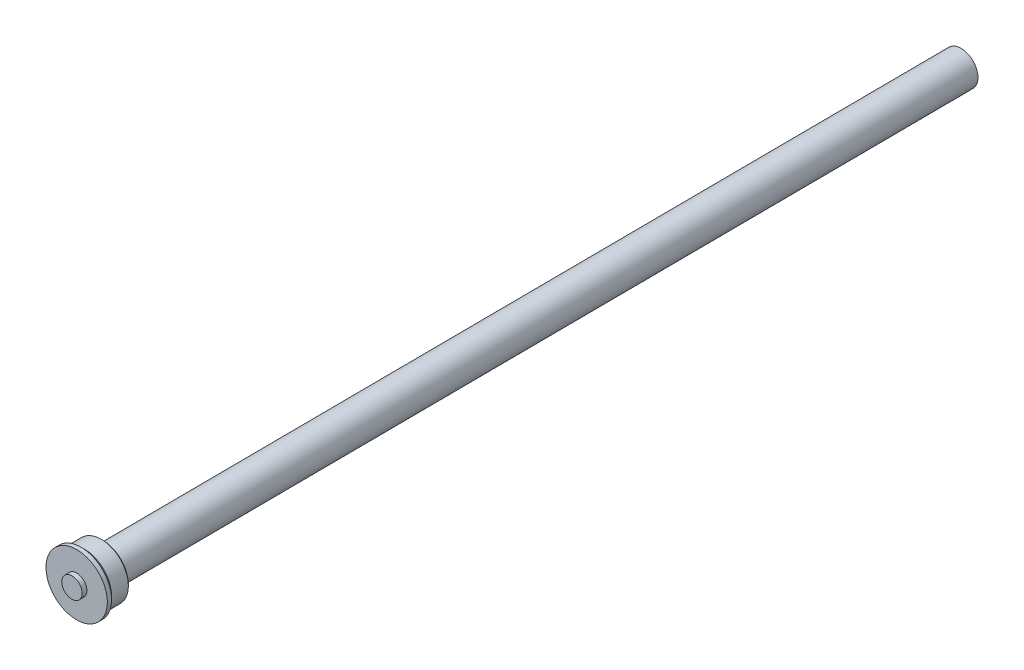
ISO-10303-21;
HEADER;
FILE_DESCRIPTION(('STEP AP214'),'2;1');
FILE_NAME('part.step','',(''),(''),'','','');
FILE_SCHEMA(('AUTOMOTIVE_DESIGN { 1 0 10303 214 1 1 1 1 }'));
ENDSEC;
DATA;
#1=APPLICATION_CONTEXT('core data for automotive mechanical design processes');
#2=APPLICATION_PROTOCOL_DEFINITION('international standard','automotive_design',2000,#1);
#3=PRODUCT_CONTEXT('',#1,'mechanical');
#4=PRODUCT('Part','Part','',(#3));
#5=PRODUCT_RELATED_PRODUCT_CATEGORY('part','',(#4));
#6=PRODUCT_DEFINITION_FORMATION('','',#4);
#7=PRODUCT_DEFINITION_CONTEXT('part definition',#1,'design');
#8=PRODUCT_DEFINITION('design','',#6,#7);
#9=PRODUCT_DEFINITION_SHAPE('','',#8);
#10=(LENGTH_UNIT() NAMED_UNIT(*) SI_UNIT(.MILLI.,.METRE.));
#11=(NAMED_UNIT(*) PLANE_ANGLE_UNIT() SI_UNIT($,.RADIAN.));
#12=(NAMED_UNIT(*) SI_UNIT($,.STERADIAN.) SOLID_ANGLE_UNIT());
#13=UNCERTAINTY_MEASURE_WITH_UNIT(LENGTH_MEASURE(1.E-05),#10,'distance_accuracy_value','');
#14=(GEOMETRIC_REPRESENTATION_CONTEXT(3) GLOBAL_UNCERTAINTY_ASSIGNED_CONTEXT((#13)) GLOBAL_UNIT_ASSIGNED_CONTEXT((#10,
#11,#12)) REPRESENTATION_CONTEXT('',''));
#15=CARTESIAN_POINT('',(0.,0.,0.));
#16=DIRECTION('',(0.,0.,1.));
#17=DIRECTION('',(1.,0.,0.));
#18=AXIS2_PLACEMENT_3D('',#15,#16,#17);
#19=CARTESIAN_POINT('',(-75.3589322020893,-1.62890534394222E-12,-206.508891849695));
#20=DIRECTION('',(0.00617464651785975,0.,0.999980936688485));
#21=DIRECTION('',(-0.98848518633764,-0.151194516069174,0.00610366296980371));
#22=AXIS2_PLACEMENT_3D('',#19,#20,#21);
#23=CONICAL_SURFACE('',#22,19.,0.785398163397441);
#24=CARTESIAN_POINT('',(-75.3527575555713,-1.62370117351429E-12,-205.508910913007));
#25=DIRECTION('',(-0.00617464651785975,0.,-0.999980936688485));
#26=DIRECTION('',(0.98848518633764,0.151194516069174,-0.00610366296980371));
#27=AXIS2_PLACEMENT_3D('',#24,#25,#26);
#28=CIRCLE('',#27,20.);
#29=CARTESIAN_POINT('',(-55.5830538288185,3.02389032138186,-205.630984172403));
#30=VERTEX_POINT('',#29);
#31=EDGE_CURVE('E28',#30,#30,#28,.F.);
#32=ORIENTED_EDGE('',*,*,#31,.F.);
#33=EDGE_LOOP('',(#32));
#34=FACE_BOUND('',#33,.T.);
#35=CARTESIAN_POINT('',(-75.3589322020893,-1.62890534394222E-12,-206.508891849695));
#36=DIRECTION('',(-0.00617464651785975,0.,-0.999980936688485));
#37=DIRECTION('',(0.98848518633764,0.151194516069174,-0.00610366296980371));
#38=AXIS2_PLACEMENT_3D('',#35,#36,#37);
#39=CIRCLE('',#38,19.);
#40=CARTESIAN_POINT('',(-56.5777136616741,2.87269580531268,-206.624861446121));
#41=VERTEX_POINT('',#40);
#42=EDGE_CURVE('E33',#41,#41,#39,.T.);
#43=ORIENTED_EDGE('',*,*,#42,.F.);
#44=EDGE_LOOP('',(#43));
#45=FACE_BOUND('',#44,.T.);
#46=ADVANCED_FACE('F16',(#34,#45),#23,.T.);
#47=CARTESIAN_POINT('',(-75.2755744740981,-1.66880398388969E-12,-193.009149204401));
#48=DIRECTION('',(0.00617464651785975,0.,0.999980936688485));
#49=DIRECTION('',(-0.98848518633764,-0.151194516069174,0.00610366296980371));
#50=AXIS2_PLACEMENT_3D('',#47,#48,#49);
#51=CONICAL_SURFACE('',#50,20.,0.785398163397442);
#52=CARTESIAN_POINT('',(-75.2601378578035,-1.6757428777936E-12,-190.509196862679));
#53=DIRECTION('',(-0.00617464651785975,0.,-0.999980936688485));
#54=DIRECTION('',(0.98848518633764,0.151194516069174,-0.00610366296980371));
#55=AXIS2_PLACEMENT_3D('',#52,#53,#54);
#56=CIRCLE('',#55,22.5);
#57=CARTESIAN_POINT('',(-53.0192211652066,3.40187661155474,-190.6465292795));
#58=VERTEX_POINT('',#57);
#59=EDGE_CURVE('E39',#58,#58,#56,.T.);
#60=ORIENTED_EDGE('',*,*,#59,.T.);
#61=EDGE_LOOP('',(#60));
#62=FACE_BOUND('',#61,.T.);
#63=CARTESIAN_POINT('',(-75.2755744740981,-1.66880398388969E-12,-193.009149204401));
#64=DIRECTION('',(-0.00617464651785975,0.,-0.999980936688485));
#65=DIRECTION('',(0.98848518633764,0.151194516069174,-0.00610366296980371));
#66=AXIS2_PLACEMENT_3D('',#63,#64,#65);
#67=CIRCLE('',#66,20.);
#68=CARTESIAN_POINT('',(-55.5058707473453,3.02389032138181,-193.131222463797));
#69=VERTEX_POINT('',#68);
#70=EDGE_CURVE('E36',#69,#69,#67,.T.);
#71=ORIENTED_EDGE('',*,*,#70,.F.);
#72=EDGE_LOOP('',(#71));
#73=FACE_BOUND('',#72,.T.);
#74=ADVANCED_FACE('F66',(#62,#73),#51,.T.);
#75=CARTESIAN_POINT('',(-75.3765937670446,-1.60982338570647E-12,-209.369173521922));
#76=DIRECTION('',(-0.00617464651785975,0.,-0.999980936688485));
#77=DIRECTION('',(0.98848518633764,0.151194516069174,-0.00610366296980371));
#78=AXIS2_PLACEMENT_3D('',#75,#76,#77);
#79=CYLINDRICAL_SURFACE('',#78,20.);
#80=ORIENTED_EDGE('',*,*,#31,.T.);
#81=EDGE_LOOP('',(#80));
#82=FACE_BOUND('',#81,.T.);
#83=ORIENTED_EDGE('',*,*,#70,.T.);
#84=EDGE_LOOP('',(#83));
#85=FACE_BOUND('',#84,.T.);
#86=ADVANCED_FACE('F73',(#82,#85),#79,.T.);
#87=CARTESIAN_POINT('',(-75.2416139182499,-1.68788594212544E-12,-187.509254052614));
#88=DIRECTION('',(-0.00617464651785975,0.,-0.999980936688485));
#89=DIRECTION('',(0.98848518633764,0.151194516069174,-0.00610366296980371));
#90=AXIS2_PLACEMENT_3D('',#87,#88,#89);
#91=CYLINDRICAL_SURFACE('',#90,22.5);
#92=ORIENTED_EDGE('',*,*,#59,.F.);
#93=EDGE_LOOP('',(#92));
#94=FACE_BOUND('',#93,.T.);
#95=CARTESIAN_POINT('',(-75.2408112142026,-1.69309011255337E-12,-187.379256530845));
#96=DIRECTION('',(-0.00617464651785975,0.,-0.999980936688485));
#97=DIRECTION('',(-0.98848518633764,-0.151194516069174,0.00610366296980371));
#98=AXIS2_PLACEMENT_3D('',#95,#96,#97);
#99=CIRCLE('',#98,22.5);
#100=CARTESIAN_POINT('',(-97.4817279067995,-3.40187661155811,-187.241924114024));
#101=VERTEX_POINT('',#100);
#102=EDGE_CURVE('E42',#101,#101,#99,.T.);
#103=ORIENTED_EDGE('',*,*,#102,.T.);
#104=EDGE_LOOP('',(#103));
#105=FACE_BOUND('',#104,.T.);
#106=ADVANCED_FACE('F80',(#94,#105),#91,.T.);
#107=CARTESIAN_POINT('',(-75.3589322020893,-1.62890534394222E-12,-206.508891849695));
#108=DIRECTION('',(-0.00617464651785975,0.,-0.999980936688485));
#109=DIRECTION('',(0.98848518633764,0.151194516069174,-0.00610366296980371));
#110=AXIS2_PLACEMENT_3D('',#107,#108,#109);
#111=PLANE('',#110);
#112=CARTESIAN_POINT('',(-75.3589322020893,-1.62890534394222E-12,-206.508891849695));
#113=DIRECTION('',(-0.00617464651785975,0.,-0.999980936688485));
#114=DIRECTION('',(-0.98848518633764,-0.151194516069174,0.00610366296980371));
#115=AXIS2_PLACEMENT_3D('',#112,#113,#114);
#116=CIRCLE('',#115,12.5);
#117=CARTESIAN_POINT('',(-87.7149970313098,-1.8899314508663,-206.432596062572));
#118=VERTEX_POINT('',#117);
#119=EDGE_CURVE('E24',#118,#118,#116,.T.);
#120=ORIENTED_EDGE('',*,*,#119,.F.);
#121=EDGE_LOOP('',(#120));
#122=FACE_BOUND('',#121,.T.);
#123=ORIENTED_EDGE('',*,*,#42,.T.);
#124=EDGE_LOOP('',(#123));
#125=FACE_BOUND('',#124,.T.);
#126=ADVANCED_FACE('F86',(#122,#125),#111,.T.);
#127=CARTESIAN_POINT('',(-79.5135760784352,7.25114412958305E-13,-879.351404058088));
#128=DIRECTION('',(0.00617464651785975,0.,0.999980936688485));
#129=DIRECTION('',(0.98848518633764,0.151194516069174,-0.00610366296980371));
#130=AXIS2_PLACEMENT_3D('',#127,#128,#129);
#131=CYLINDRICAL_SURFACE('',#130,12.5);
#132=ORIENTED_EDGE('',*,*,#119,.T.);
#133=EDGE_LOOP('',(#132));
#134=FACE_BOUND('',#133,.T.);
#135=CARTESIAN_POINT('',(-79.2952693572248,5.95010152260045E-13,-843.996738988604));
#136=DIRECTION('',(0.00617464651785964,0.,0.999980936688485));
#137=DIRECTION('',(0.98848518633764,0.151194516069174,-0.00610366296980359));
#138=AXIS2_PLACEMENT_3D('',#135,#136,#137);
#139=CIRCLE('',#138,12.5);
#140=CARTESIAN_POINT('',(-66.9392045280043,1.88993145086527,-844.073034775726));
#141=VERTEX_POINT('',#140);
#142=EDGE_CURVE('E10',#141,#141,#139,.T.);
#143=ORIENTED_EDGE('',*,*,#142,.T.);
#144=EDGE_LOOP('',(#143));
#145=FACE_BOUND('',#144,.T.);
#146=ADVANCED_FACE('F83',(#134,#145),#131,.T.);
#147=CARTESIAN_POINT('',(-79.2952693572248,5.95010152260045E-13,-843.996738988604));
#148=DIRECTION('',(0.00617464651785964,0.,0.999980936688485));
#149=DIRECTION('',(0.98848518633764,0.151194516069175,-0.00610366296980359));
#150=AXIS2_PLACEMENT_3D('',#147,#148,#149);
#151=PLANE('',#150);
#152=ORIENTED_EDGE('',*,*,#142,.F.);
#153=EDGE_LOOP('',(#152));
#154=FACE_BOUND('',#153,.T.);
#155=ADVANCED_FACE('F61',(#154),#151,.F.);
#156=CARTESIAN_POINT('',(-75.2408112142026,-1.69309011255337E-12,-187.379256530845));
#157=DIRECTION('',(-0.00617464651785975,0.,-0.999980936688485));
#158=DIRECTION('',(0.98848518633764,0.151194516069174,-0.00610366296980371));
#159=AXIS2_PLACEMENT_3D('',#156,#157,#158);
#160=PLANE('',#159);
#161=CARTESIAN_POINT('',(-75.2408112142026,-1.69309011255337E-12,-187.379256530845));
#162=DIRECTION('',(-0.00617464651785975,0.,-0.999980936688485));
#163=DIRECTION('',(-0.98848518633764,-0.151194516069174,0.00610366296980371));
#164=AXIS2_PLACEMENT_3D('',#161,#162,#163);
#165=CIRCLE('',#164,7.5);
#166=CARTESIAN_POINT('',(-82.6544501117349,-1.1339588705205,-187.333479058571));
#167=VERTEX_POINT('',#166);
#168=EDGE_CURVE('E20',#167,#167,#165,.F.);
#169=ORIENTED_EDGE('',*,*,#168,.F.);
#170=EDGE_LOOP('',(#169));
#171=FACE_BOUND('',#170,.T.);
#172=ORIENTED_EDGE('',*,*,#102,.F.);
#173=EDGE_LOOP('',(#172));
#174=FACE_BOUND('',#173,.T.);
#175=ADVANCED_FACE('F52',(#171,#174),#160,.F.);
#176=CARTESIAN_POINT('',(-75.2200026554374,-1.70349845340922E-12,-184.009320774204));
#177=DIRECTION('',(0.00617464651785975,0.,0.999980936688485));
#178=DIRECTION('',(0.98848518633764,0.151194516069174,-0.00610366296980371));
#179=AXIS2_PLACEMENT_3D('',#176,#177,#178);
#180=CYLINDRICAL_SURFACE('',#179,7.5);
#181=ORIENTED_EDGE('',*,*,#168,.T.);
#182=EDGE_LOOP('',(#181));
#183=FACE_BOUND('',#182,.T.);
#184=CARTESIAN_POINT('',(-75.21919995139,-1.69309011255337E-12,-183.879323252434));
#185=DIRECTION('',(0.00617464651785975,0.,0.999980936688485));
#186=DIRECTION('',(0.98848518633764,0.151194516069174,-0.00610366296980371));
#187=AXIS2_PLACEMENT_3D('',#184,#185,#186);
#188=CIRCLE('',#187,7.5);
#189=CARTESIAN_POINT('',(-67.8055610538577,1.13395887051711,-183.925100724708));
#190=VERTEX_POINT('',#189);
#191=EDGE_CURVE('E45',#190,#190,#188,.T.);
#192=ORIENTED_EDGE('',*,*,#191,.F.);
#193=EDGE_LOOP('',(#192));
#194=FACE_BOUND('',#193,.T.);
#195=ADVANCED_FACE('F18',(#183,#194),#180,.T.);
#196=CARTESIAN_POINT('',(-75.21919995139,-1.69309011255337E-12,-183.879323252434));
#197=DIRECTION('',(0.00617464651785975,0.,0.999980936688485));
#198=DIRECTION('',(0.98848518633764,0.151194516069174,-0.00610366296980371));
#199=AXIS2_PLACEMENT_3D('',#196,#197,#198);
#200=PLANE('',#199);
#201=ORIENTED_EDGE('',*,*,#191,.T.);
#202=EDGE_LOOP('',(#201));
#203=FACE_BOUND('',#202,.T.);
#204=ADVANCED_FACE('F49',(#203),#200,.T.);
#205=CLOSED_SHELL('',(#46,#74,#86,#106,#126,#146,#155,#175,#195,#204));
#206=MANIFOLD_SOLID_BREP('B1',#205);
#207=ADVANCED_BREP_SHAPE_REPRESENTATION('',(#18,#206),#14);
#208=SHAPE_DEFINITION_REPRESENTATION(#9,#207);
ENDSEC;
END-ISO-10303-21;
